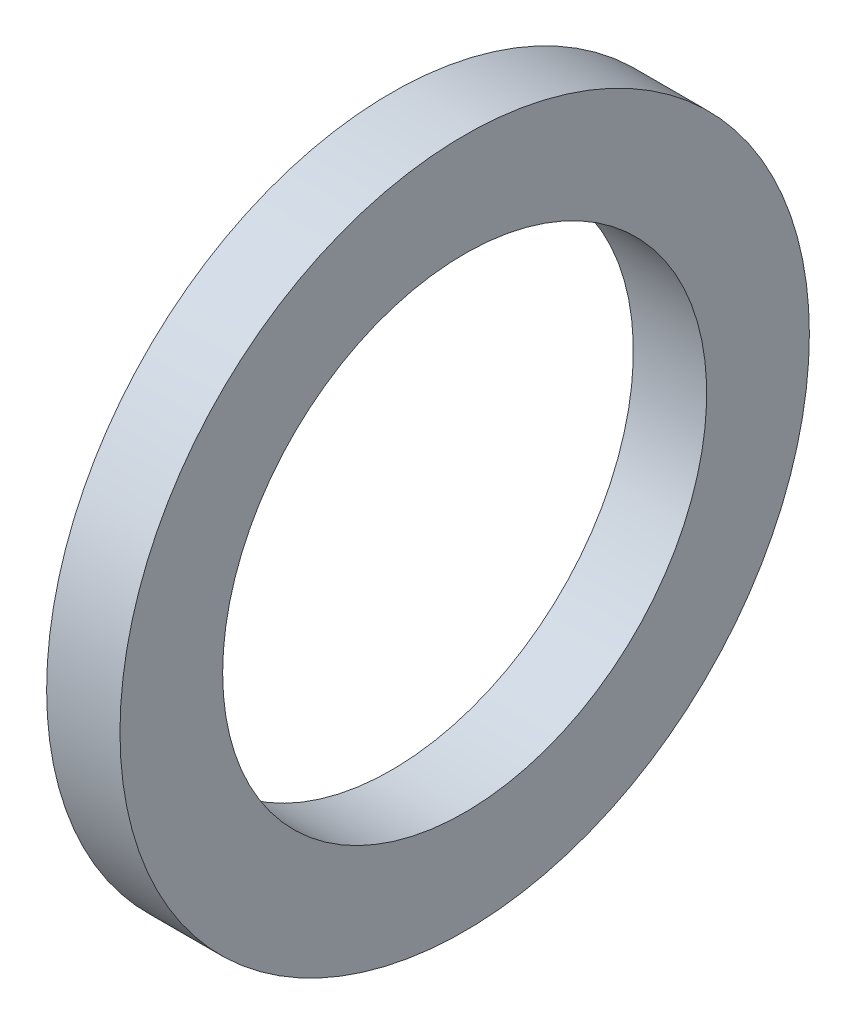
ISO-10303-21;
HEADER;
FILE_DESCRIPTION(('STEP AP214'),'2;1');
FILE_NAME('part.step','',(''),(''),'','','');
FILE_SCHEMA(('AUTOMOTIVE_DESIGN { 1 0 10303 214 1 1 1 1 }'));
ENDSEC;
DATA;
#1=APPLICATION_CONTEXT('core data for automotive mechanical design processes');
#2=APPLICATION_PROTOCOL_DEFINITION('international standard','automotive_design',2000,#1);
#3=PRODUCT_CONTEXT('',#1,'mechanical');
#4=PRODUCT('Part','Part','',(#3));
#5=PRODUCT_RELATED_PRODUCT_CATEGORY('part','',(#4));
#6=PRODUCT_DEFINITION_FORMATION('','',#4);
#7=PRODUCT_DEFINITION_CONTEXT('part definition',#1,'design');
#8=PRODUCT_DEFINITION('design','',#6,#7);
#9=PRODUCT_DEFINITION_SHAPE('','',#8);
#10=(LENGTH_UNIT() NAMED_UNIT(*) SI_UNIT(.MILLI.,.METRE.));
#11=(NAMED_UNIT(*) PLANE_ANGLE_UNIT() SI_UNIT($,.RADIAN.));
#12=(NAMED_UNIT(*) SI_UNIT($,.STERADIAN.) SOLID_ANGLE_UNIT());
#13=UNCERTAINTY_MEASURE_WITH_UNIT(LENGTH_MEASURE(1.E-05),#10,'distance_accuracy_value','');
#14=(GEOMETRIC_REPRESENTATION_CONTEXT(3) GLOBAL_UNCERTAINTY_ASSIGNED_CONTEXT((#13)) GLOBAL_UNIT_ASSIGNED_CONTEXT((#10,
#11,#12)) REPRESENTATION_CONTEXT('',''));
#15=CARTESIAN_POINT('',(0.,0.,0.));
#16=DIRECTION('',(0.,0.,1.));
#17=DIRECTION('',(1.,0.,0.));
#18=AXIS2_PLACEMENT_3D('',#15,#16,#17);
#19=CARTESIAN_POINT('',(-34.9249999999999,0.,0.));
#20=DIRECTION('',(-1.,0.,0.));
#21=DIRECTION('',(0.,0.,1.));
#22=AXIS2_PLACEMENT_3D('',#19,#20,#21);
#23=CYLINDRICAL_SURFACE('',#22,16.5);
#24=CARTESIAN_POINT('',(0.,0.,0.));
#25=DIRECTION('',(-1.,0.,0.));
#26=DIRECTION('',(0.,0.,1.));
#27=AXIS2_PLACEMENT_3D('',#24,#25,#26);
#28=CIRCLE('',#27,16.5);
#29=CARTESIAN_POINT('',(0.,0.,16.5));
#30=VERTEX_POINT('',#29);
#31=EDGE_CURVE('E10',#30,#30,#28,.T.);
#32=ORIENTED_EDGE('',*,*,#31,.F.);
#33=EDGE_LOOP('',(#32));
#34=FACE_BOUND('',#33,.T.);
#35=CARTESIAN_POINT('',(-5.,0.,0.));
#36=DIRECTION('',(-1.,0.,0.));
#37=DIRECTION('',(0.,0.,1.));
#38=AXIS2_PLACEMENT_3D('',#35,#36,#37);
#39=CIRCLE('',#38,16.5);
#40=CARTESIAN_POINT('',(-5.,0.,16.5));
#41=VERTEX_POINT('',#40);
#42=EDGE_CURVE('E45',#41,#41,#39,.T.);
#43=ORIENTED_EDGE('',*,*,#42,.T.);
#44=EDGE_LOOP('',(#43));
#45=FACE_BOUND('',#44,.T.);
#46=ADVANCED_FACE('F31',(#34,#45),#23,.F.);
#47=CARTESIAN_POINT('',(0.,16.5,0.));
#48=DIRECTION('',(-1.,0.,0.));
#49=DIRECTION('',(0.,0.,1.));
#50=AXIS2_PLACEMENT_3D('',#47,#48,#49);
#51=PLANE('',#50);
#52=CARTESIAN_POINT('',(0.,0.,0.));
#53=DIRECTION('',(-1.,0.,0.));
#54=DIRECTION('',(0.,0.,1.));
#55=AXIS2_PLACEMENT_3D('',#52,#53,#54);
#56=CIRCLE('',#55,23.5);
#57=CARTESIAN_POINT('',(0.,0.,23.5));
#58=VERTEX_POINT('',#57);
#59=EDGE_CURVE('E37',#58,#58,#56,.T.);
#60=ORIENTED_EDGE('',*,*,#59,.F.);
#61=EDGE_LOOP('',(#60));
#62=FACE_BOUND('',#61,.T.);
#63=ORIENTED_EDGE('',*,*,#31,.T.);
#64=EDGE_LOOP('',(#63));
#65=FACE_BOUND('',#64,.T.);
#66=ADVANCED_FACE('F60',(#62,#65),#51,.F.);
#67=CARTESIAN_POINT('',(-34.9249999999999,0.,0.));
#68=DIRECTION('',(-1.,0.,0.));
#69=DIRECTION('',(0.,0.,1.));
#70=AXIS2_PLACEMENT_3D('',#67,#68,#69);
#71=CYLINDRICAL_SURFACE('',#70,23.5);
#72=CARTESIAN_POINT('',(-5.,0.,0.));
#73=DIRECTION('',(-1.,0.,0.));
#74=DIRECTION('',(0.,0.,1.));
#75=AXIS2_PLACEMENT_3D('',#72,#73,#74);
#76=CIRCLE('',#75,23.5);
#77=CARTESIAN_POINT('',(-5.,0.,23.5));
#78=VERTEX_POINT('',#77);
#79=EDGE_CURVE('E41',#78,#78,#76,.T.);
#80=ORIENTED_EDGE('',*,*,#79,.F.);
#81=EDGE_LOOP('',(#80));
#82=FACE_BOUND('',#81,.T.);
#83=ORIENTED_EDGE('',*,*,#59,.T.);
#84=EDGE_LOOP('',(#83));
#85=FACE_BOUND('',#84,.T.);
#86=ADVANCED_FACE('F55',(#82,#85),#71,.T.);
#87=CARTESIAN_POINT('',(-5.,23.5,0.));
#88=DIRECTION('',(1.,0.,0.));
#89=DIRECTION('',(0.,0.,-1.));
#90=AXIS2_PLACEMENT_3D('',#87,#88,#89);
#91=PLANE('',#90);
#92=ORIENTED_EDGE('',*,*,#42,.F.);
#93=EDGE_LOOP('',(#92));
#94=FACE_BOUND('',#93,.T.);
#95=ORIENTED_EDGE('',*,*,#79,.T.);
#96=EDGE_LOOP('',(#95));
#97=FACE_BOUND('',#96,.T.);
#98=ADVANCED_FACE('F52',(#94,#97),#91,.F.);
#99=CLOSED_SHELL('',(#46,#66,#86,#98));
#100=MANIFOLD_SOLID_BREP('B2',#99);
#101=ADVANCED_BREP_SHAPE_REPRESENTATION('',(#18,#100),#14);
#102=SHAPE_DEFINITION_REPRESENTATION(#9,#101);
ENDSEC;
END-ISO-10303-21;
